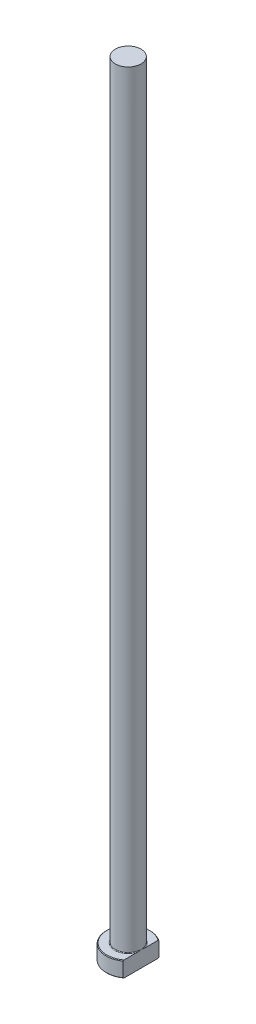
from build123d import *
from build123d.topology import SkipClean

# Parameters (mm, degrees)
CHAMFER1_SIZE = 0.2
FILLET1_R     = 0.2
KEY_DEPTH     = 251.195923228


with BuildPart() as part:
    # Sketch1 → Revolve1 (revolve)
    with BuildSketch(Plane.XY, mode=Mode.PRIVATE) as revolve1_sk:
        Polygon((0, 0), (-7, 0), (-7, 5), (-4.1, 5), (-4.1, 250), (0, 250), align=None)
    revolve(revolve1_sk.sketch.rotate(Axis((0, 259.958771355, 0), (0, -1, 0)), 270), axis=Axis((0, 259.958771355, 0), (0, -1, 0)))

    # Chamfer1
    chamfer1_edges = [part.edges().sort_by_distance(p)[0] for p in [
        (0, 5, -7),
        (0, 0, -7),
    ]]
    chamfer(chamfer1_edges, length=CHAMFER1_SIZE)

    # Fillet1
    fillet1_edges = [part.edges().sort_by_distance(p)[0] for p in [
        (0, 5, -4.1),
    ]]
    fillet(fillet1_edges, radius=FILLET1_R)

    # Sketch2 → KEY (cut, through all)
    with SkipClean():  # the faces are left unmerged after this step: merging them gives an invalid solid
        with BuildSketch(Plane(origin=(0, 0, 0), x_dir=(1, 0, 0), z_dir=(0, 1, 0))):
            with BuildLine():
                Line((4.1, 5.673623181), (4.1, -5.673623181))
                ThreePointArc((4.1, -5.673623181), (7, 0), (4.1, 5.673623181))
            make_face()
        extrude(amount=KEY_DEPTH, mode=Mode.SUBTRACT)


solid = part.part
